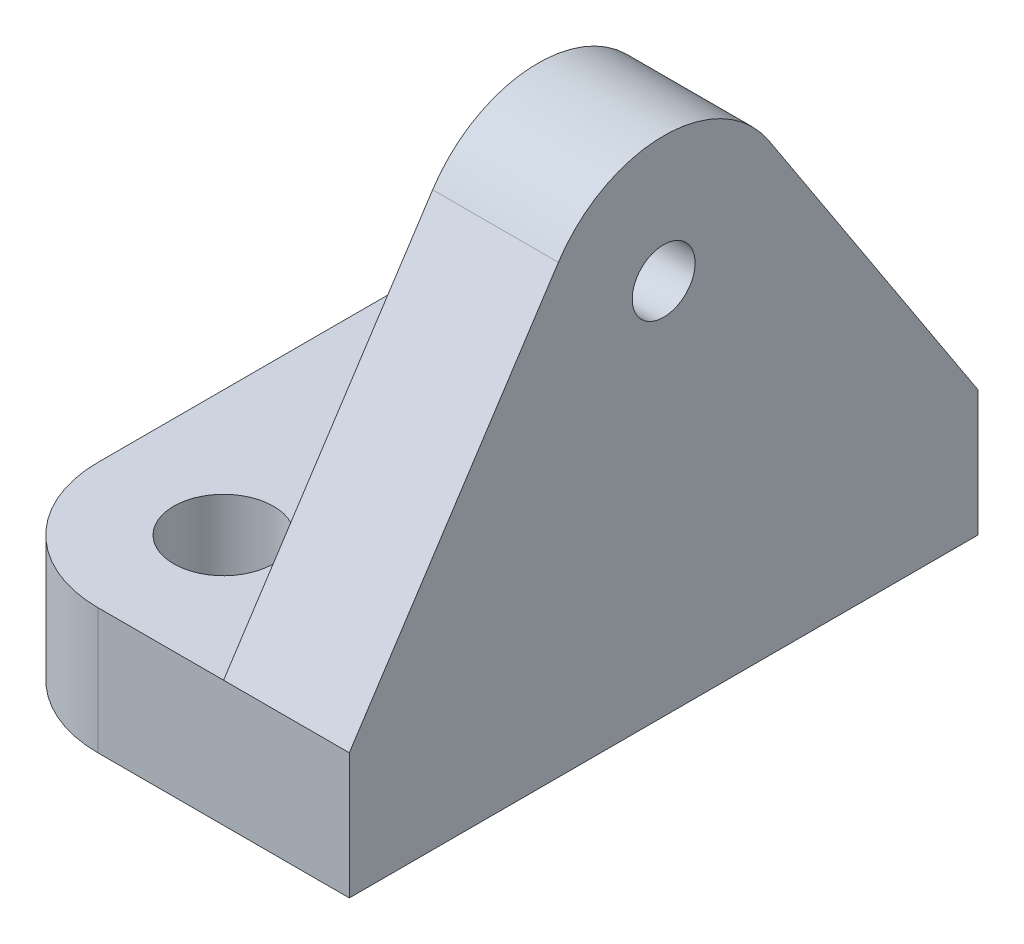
ISO-10303-21;
HEADER;
FILE_DESCRIPTION(('STEP AP214'),'2;1');
FILE_NAME('part.step','',(''),(''),'','','');
FILE_SCHEMA(('AUTOMOTIVE_DESIGN { 1 0 10303 214 1 1 1 1 }'));
ENDSEC;
DATA;
#1=APPLICATION_CONTEXT('core data for automotive mechanical design processes');
#2=APPLICATION_PROTOCOL_DEFINITION('international standard','automotive_design',2000,#1);
#3=PRODUCT_CONTEXT('',#1,'mechanical');
#4=PRODUCT('Part','Part','',(#3));
#5=PRODUCT_RELATED_PRODUCT_CATEGORY('part','',(#4));
#6=PRODUCT_DEFINITION_FORMATION('','',#4);
#7=PRODUCT_DEFINITION_CONTEXT('part definition',#1,'design');
#8=PRODUCT_DEFINITION('design','',#6,#7);
#9=PRODUCT_DEFINITION_SHAPE('','',#8);
#10=(LENGTH_UNIT() NAMED_UNIT(*) SI_UNIT(.MILLI.,.METRE.));
#11=(NAMED_UNIT(*) PLANE_ANGLE_UNIT() SI_UNIT($,.RADIAN.));
#12=(NAMED_UNIT(*) SI_UNIT($,.STERADIAN.) SOLID_ANGLE_UNIT());
#13=UNCERTAINTY_MEASURE_WITH_UNIT(LENGTH_MEASURE(1.E-05),#10,'distance_accuracy_value','');
#14=(GEOMETRIC_REPRESENTATION_CONTEXT(3) GLOBAL_UNCERTAINTY_ASSIGNED_CONTEXT((#13)) GLOBAL_UNIT_ASSIGNED_CONTEXT((#10,
#11,#12)) REPRESENTATION_CONTEXT('',''));
#15=CARTESIAN_POINT('',(0.,0.,0.));
#16=DIRECTION('',(0.,0.,1.));
#17=DIRECTION('',(1.,0.,0.));
#18=AXIS2_PLACEMENT_3D('',#15,#16,#17);
#19=CARTESIAN_POINT('',(38.1,-12.7,0.));
#20=DIRECTION('',(1.,0.,0.));
#21=DIRECTION('',(0.,0.,-1.));
#22=AXIS2_PLACEMENT_3D('',#19,#20,#21);
#23=PLANE('',#22);
#24=DIRECTION('',(0.,1.,0.));
#25=VECTOR('',#24,1.);
#26=CARTESIAN_POINT('',(38.1,-12.7,-63.5));
#27=LINE('',#26,#25);
#28=CARTESIAN_POINT('',(38.1,-12.7,-63.5));
#29=VERTEX_POINT('',#28);
#30=CARTESIAN_POINT('',(38.1,0.,-63.5));
#31=VERTEX_POINT('',#30);
#32=EDGE_CURVE('E84',#29,#31,#27,.T.);
#33=ORIENTED_EDGE('',*,*,#32,.T.);
#34=DIRECTION('',(0.,0.837342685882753,0.546678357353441));
#35=VECTOR('',#34,1.);
#36=CARTESIAN_POINT('',(38.1,0.,-63.5));
#37=LINE('',#36,#35);
#38=CARTESIAN_POINT('',(38.1,32.3428151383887,-42.384252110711));
#39=VERTEX_POINT('',#38);
#40=EDGE_CURVE('E156',#31,#39,#37,.T.);
#41=ORIENTED_EDGE('',*,*,#40,.T.);
#42=CARTESIAN_POINT('',(38.1,25.4,-31.75));
#43=DIRECTION('',(1.,0.,0.));
#44=DIRECTION('',(0.,0.,-1.));
#45=AXIS2_PLACEMENT_3D('',#42,#43,#44);
#46=CIRCLE('',#45,12.7);
#47=CARTESIAN_POINT('',(38.1,32.3428151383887,-21.115747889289));
#48=VERTEX_POINT('',#47);
#49=EDGE_CURVE('E173',#39,#48,#46,.T.);
#50=ORIENTED_EDGE('',*,*,#49,.T.);
#51=DIRECTION('',(0.,-0.837342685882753,0.546678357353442));
#52=VECTOR('',#51,1.);
#53=CARTESIAN_POINT('',(38.1,0.,0.));
#54=LINE('',#53,#52);
#55=CARTESIAN_POINT('',(38.1,0.,0.));
#56=VERTEX_POINT('',#55);
#57=EDGE_CURVE('E171',#48,#56,#54,.T.);
#58=ORIENTED_EDGE('',*,*,#57,.T.);
#59=DIRECTION('',(0.,1.,0.));
#60=VECTOR('',#59,1.);
#61=CARTESIAN_POINT('',(38.1,-12.7,0.));
#62=LINE('',#61,#60);
#63=CARTESIAN_POINT('',(38.1,-12.7,0.));
#64=VERTEX_POINT('',#63);
#65=EDGE_CURVE('E11',#64,#56,#62,.T.);
#66=ORIENTED_EDGE('',*,*,#65,.F.);
#67=DIRECTION('',(0.,0.,-1.));
#68=VECTOR('',#67,1.);
#69=CARTESIAN_POINT('',(38.1,-12.7,0.));
#70=LINE('',#69,#68);
#71=EDGE_CURVE('E139',#64,#29,#70,.T.);
#72=ORIENTED_EDGE('',*,*,#71,.T.);
#73=EDGE_LOOP('',(#33,#41,#50,#58,#66,#72));
#74=FACE_BOUND('',#73,.T.);
#75=CARTESIAN_POINT('',(38.1,25.4,-31.75));
#76=DIRECTION('',(1.,0.,0.));
#77=DIRECTION('',(0.,0.,-1.));
#78=AXIS2_PLACEMENT_3D('',#75,#76,#77);
#79=CIRCLE('',#78,3.175);
#80=CARTESIAN_POINT('',(38.1,25.4,-34.925));
#81=VERTEX_POINT('',#80);
#82=EDGE_CURVE('E207',#81,#81,#79,.T.);
#83=ORIENTED_EDGE('',*,*,#82,.F.);
#84=EDGE_LOOP('',(#83));
#85=FACE_BOUND('',#84,.T.);
#86=ADVANCED_FACE('F31',(#74,#85),#23,.T.);
#87=CARTESIAN_POINT('',(12.7000000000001,-12.7,0.));
#88=DIRECTION('',(0.,0.,1.));
#89=DIRECTION('',(1.,0.,0.));
#90=AXIS2_PLACEMENT_3D('',#87,#88,#89);
#91=PLANE('',#90);
#92=DIRECTION('',(1.,0.,0.));
#93=VECTOR('',#92,1.);
#94=CARTESIAN_POINT('',(12.7000000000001,0.,0.));
#95=LINE('',#94,#93);
#96=CARTESIAN_POINT('',(12.7000000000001,0.,0.));
#97=VERTEX_POINT('',#96);
#98=CARTESIAN_POINT('',(25.4,0.,0.));
#99=VERTEX_POINT('',#98);
#100=EDGE_CURVE('E135',#97,#99,#95,.T.);
#101=ORIENTED_EDGE('',*,*,#100,.F.);
#102=DIRECTION('',(0.,1.,0.));
#103=VECTOR('',#102,1.);
#104=CARTESIAN_POINT('',(12.7000000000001,-12.7,0.));
#105=LINE('',#104,#103);
#106=CARTESIAN_POINT('',(12.7000000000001,-12.7,0.));
#107=VERTEX_POINT('',#106);
#108=EDGE_CURVE('E39',#107,#97,#105,.T.);
#109=ORIENTED_EDGE('',*,*,#108,.F.);
#110=DIRECTION('',(1.,0.,0.));
#111=VECTOR('',#110,1.);
#112=CARTESIAN_POINT('',(12.7000000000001,-12.7,0.));
#113=LINE('',#112,#111);
#114=EDGE_CURVE('E114',#107,#64,#113,.T.);
#115=ORIENTED_EDGE('',*,*,#114,.T.);
#116=ORIENTED_EDGE('',*,*,#65,.T.);
#117=DIRECTION('',(1.,0.,0.));
#118=VECTOR('',#117,1.);
#119=CARTESIAN_POINT('',(25.4,0.,0.));
#120=LINE('',#119,#118);
#121=EDGE_CURVE('E182',#99,#56,#120,.T.);
#122=ORIENTED_EDGE('',*,*,#121,.F.);
#123=EDGE_LOOP('',(#101,#109,#115,#116,#122));
#124=FACE_BOUND('',#123,.T.);
#125=ADVANCED_FACE('F192',(#124),#91,.T.);
#126=CARTESIAN_POINT('',(12.7,-12.7,-12.7));
#127=DIRECTION('',(0.,1.,0.));
#128=DIRECTION('',(0.,0.,1.));
#129=AXIS2_PLACEMENT_3D('',#126,#127,#128);
#130=CYLINDRICAL_SURFACE('',#129,12.7);
#131=CARTESIAN_POINT('',(12.7,0.,-12.7));
#132=DIRECTION('',(0.,1.,0.));
#133=DIRECTION('',(0.,0.,-1.));
#134=AXIS2_PLACEMENT_3D('',#131,#132,#133);
#135=CIRCLE('',#134,12.7);
#136=CARTESIAN_POINT('',(0.,0.,-12.7000000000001));
#137=VERTEX_POINT('',#136);
#138=EDGE_CURVE('E100',#137,#97,#135,.T.);
#139=ORIENTED_EDGE('',*,*,#138,.F.);
#140=DIRECTION('',(0.,1.,0.));
#141=VECTOR('',#140,1.);
#142=CARTESIAN_POINT('',(0.,-12.7,-12.7000000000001));
#143=LINE('',#142,#141);
#144=CARTESIAN_POINT('',(0.,-12.7,-12.7000000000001));
#145=VERTEX_POINT('',#144);
#146=EDGE_CURVE('E95',#145,#137,#143,.T.);
#147=ORIENTED_EDGE('',*,*,#146,.F.);
#148=CARTESIAN_POINT('',(12.7,-12.7,-12.7));
#149=DIRECTION('',(0.,1.,0.));
#150=DIRECTION('',(0.,0.,-1.));
#151=AXIS2_PLACEMENT_3D('',#148,#149,#150);
#152=CIRCLE('',#151,12.7);
#153=EDGE_CURVE('E98',#145,#107,#152,.T.);
#154=ORIENTED_EDGE('',*,*,#153,.T.);
#155=ORIENTED_EDGE('',*,*,#108,.T.);
#156=EDGE_LOOP('',(#139,#147,#154,#155));
#157=FACE_BOUND('',#156,.T.);
#158=ADVANCED_FACE('F97',(#157),#130,.T.);
#159=CARTESIAN_POINT('',(0.,-12.7,-12.7000000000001));
#160=DIRECTION('',(-1.,0.,0.));
#161=DIRECTION('',(0.,0.,1.));
#162=AXIS2_PLACEMENT_3D('',#159,#160,#161);
#163=PLANE('',#162);
#164=DIRECTION('',(0.,0.,1.));
#165=VECTOR('',#164,1.);
#166=CARTESIAN_POINT('',(0.,0.,-12.7000000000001));
#167=LINE('',#166,#165);
#168=CARTESIAN_POINT('',(0.,0.,-50.7999999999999));
#169=VERTEX_POINT('',#168);
#170=EDGE_CURVE('E189',#169,#137,#167,.T.);
#171=ORIENTED_EDGE('',*,*,#170,.F.);
#172=DIRECTION('',(0.,1.,0.));
#173=VECTOR('',#172,1.);
#174=CARTESIAN_POINT('',(0.,-12.7,-50.7999999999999));
#175=LINE('',#174,#173);
#176=CARTESIAN_POINT('',(0.,-12.7,-50.7999999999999));
#177=VERTEX_POINT('',#176);
#178=EDGE_CURVE('E105',#177,#169,#175,.T.);
#179=ORIENTED_EDGE('',*,*,#178,.F.);
#180=DIRECTION('',(0.,0.,1.));
#181=VECTOR('',#180,1.);
#182=CARTESIAN_POINT('',(0.,-12.7,-12.7000000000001));
#183=LINE('',#182,#181);
#184=EDGE_CURVE('E111',#177,#145,#183,.T.);
#185=ORIENTED_EDGE('',*,*,#184,.T.);
#186=ORIENTED_EDGE('',*,*,#146,.T.);
#187=EDGE_LOOP('',(#171,#179,#185,#186));
#188=FACE_BOUND('',#187,.T.);
#189=ADVANCED_FACE('F116',(#188),#163,.T.);
#190=CARTESIAN_POINT('',(12.7,-12.7,-50.8));
#191=DIRECTION('',(0.,1.,0.));
#192=DIRECTION('',(0.,0.,1.));
#193=AXIS2_PLACEMENT_3D('',#190,#191,#192);
#194=CYLINDRICAL_SURFACE('',#193,12.7);
#195=CARTESIAN_POINT('',(12.7,0.,-50.8));
#196=DIRECTION('',(0.,1.,0.));
#197=DIRECTION('',(0.,0.,-1.));
#198=AXIS2_PLACEMENT_3D('',#195,#196,#197);
#199=CIRCLE('',#198,12.7);
#200=CARTESIAN_POINT('',(12.7000000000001,0.,-63.5));
#201=VERTEX_POINT('',#200);
#202=EDGE_CURVE('E126',#201,#169,#199,.T.);
#203=ORIENTED_EDGE('',*,*,#202,.F.);
#204=DIRECTION('',(0.,1.,0.));
#205=VECTOR('',#204,1.);
#206=CARTESIAN_POINT('',(12.7000000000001,-12.7,-63.5));
#207=LINE('',#206,#205);
#208=CARTESIAN_POINT('',(12.7000000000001,-12.7,-63.5));
#209=VERTEX_POINT('',#208);
#210=EDGE_CURVE('E148',#209,#201,#207,.T.);
#211=ORIENTED_EDGE('',*,*,#210,.F.);
#212=CARTESIAN_POINT('',(12.7,-12.7,-50.8));
#213=DIRECTION('',(0.,1.,0.));
#214=DIRECTION('',(0.,0.,-1.));
#215=AXIS2_PLACEMENT_3D('',#212,#213,#214);
#216=CIRCLE('',#215,12.7);
#217=EDGE_CURVE('E117',#209,#177,#216,.T.);
#218=ORIENTED_EDGE('',*,*,#217,.T.);
#219=ORIENTED_EDGE('',*,*,#178,.T.);
#220=EDGE_LOOP('',(#203,#211,#218,#219));
#221=FACE_BOUND('',#220,.T.);
#222=ADVANCED_FACE('F188',(#221),#194,.T.);
#223=CARTESIAN_POINT('',(12.7000000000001,-12.7,-63.5));
#224=DIRECTION('',(0.,0.,-1.));
#225=DIRECTION('',(-1.,0.,0.));
#226=AXIS2_PLACEMENT_3D('',#223,#224,#225);
#227=PLANE('',#226);
#228=DIRECTION('',(-1.,0.,0.));
#229=VECTOR('',#228,1.);
#230=CARTESIAN_POINT('',(12.7000000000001,0.,-63.5));
#231=LINE('',#230,#229);
#232=CARTESIAN_POINT('',(25.4,0.,-63.5));
#233=VERTEX_POINT('',#232);
#234=EDGE_CURVE('E133',#31,#233,#231,.T.);
#235=ORIENTED_EDGE('',*,*,#234,.F.);
#236=ORIENTED_EDGE('',*,*,#32,.F.);
#237=DIRECTION('',(-1.,0.,0.));
#238=VECTOR('',#237,1.);
#239=CARTESIAN_POINT('',(12.7000000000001,-12.7,-63.5));
#240=LINE('',#239,#238);
#241=EDGE_CURVE('E119',#29,#209,#240,.T.);
#242=ORIENTED_EDGE('',*,*,#241,.T.);
#243=ORIENTED_EDGE('',*,*,#210,.T.);
#244=EDGE_CURVE('E130',#233,#201,#231,.T.);
#245=ORIENTED_EDGE('',*,*,#244,.F.);
#246=EDGE_LOOP('',(#235,#236,#242,#243,#245));
#247=FACE_BOUND('',#246,.T.);
#248=ADVANCED_FACE('F159',(#247),#227,.T.);
#249=CARTESIAN_POINT('',(12.7,-12.7,-50.8));
#250=DIRECTION('',(0.,-1.,0.));
#251=DIRECTION('',(0.,0.,-1.));
#252=AXIS2_PLACEMENT_3D('',#249,#250,#251);
#253=PLANE('',#252);
#254=CARTESIAN_POINT('',(12.7,-12.7,-50.8));
#255=DIRECTION('',(0.,-1.,0.));
#256=DIRECTION('',(0.,0.,-1.));
#257=AXIS2_PLACEMENT_3D('',#254,#255,#256);
#258=CIRCLE('',#257,5.04189999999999);
#259=CARTESIAN_POINT('',(12.7,-12.7,-55.8419));
#260=VERTEX_POINT('',#259);
#261=EDGE_CURVE('E219',#260,#260,#258,.T.);
#262=ORIENTED_EDGE('',*,*,#261,.F.);
#263=EDGE_LOOP('',(#262));
#264=FACE_BOUND('',#263,.T.);
#265=CARTESIAN_POINT('',(12.7,-12.7,-12.7));
#266=DIRECTION('',(0.,-1.,0.));
#267=DIRECTION('',(0.,0.,-1.));
#268=AXIS2_PLACEMENT_3D('',#265,#266,#267);
#269=CIRCLE('',#268,5.04189999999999);
#270=CARTESIAN_POINT('',(12.7,-12.7,-17.7419));
#271=VERTEX_POINT('',#270);
#272=EDGE_CURVE('E208',#271,#271,#269,.T.);
#273=ORIENTED_EDGE('',*,*,#272,.F.);
#274=EDGE_LOOP('',(#273));
#275=FACE_BOUND('',#274,.T.);
#276=ORIENTED_EDGE('',*,*,#71,.F.);
#277=ORIENTED_EDGE('',*,*,#114,.F.);
#278=ORIENTED_EDGE('',*,*,#153,.F.);
#279=ORIENTED_EDGE('',*,*,#184,.F.);
#280=ORIENTED_EDGE('',*,*,#217,.F.);
#281=ORIENTED_EDGE('',*,*,#241,.F.);
#282=EDGE_LOOP('',(#276,#277,#278,#279,#280,#281));
#283=FACE_BOUND('',#282,.T.);
#284=ADVANCED_FACE('F109',(#264,#275,#283),#253,.T.);
#285=CARTESIAN_POINT('',(12.7,0.,-50.8));
#286=DIRECTION('',(0.,-1.,0.));
#287=DIRECTION('',(0.,0.,-1.));
#288=AXIS2_PLACEMENT_3D('',#285,#286,#287);
#289=PLANE('',#288);
#290=CARTESIAN_POINT('',(12.7,0.,-50.8));
#291=DIRECTION('',(0.,-1.,0.));
#292=DIRECTION('',(0.,0.,-1.));
#293=AXIS2_PLACEMENT_3D('',#290,#291,#292);
#294=CIRCLE('',#293,5.04189999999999);
#295=CARTESIAN_POINT('',(12.7,0.,-55.8419));
#296=VERTEX_POINT('',#295);
#297=EDGE_CURVE('E34',#296,#296,#294,.T.);
#298=ORIENTED_EDGE('',*,*,#297,.T.);
#299=EDGE_LOOP('',(#298));
#300=FACE_BOUND('',#299,.T.);
#301=CARTESIAN_POINT('',(12.7,0.,-12.7));
#302=DIRECTION('',(0.,-1.,0.));
#303=DIRECTION('',(0.,0.,-1.));
#304=AXIS2_PLACEMENT_3D('',#301,#302,#303);
#305=CIRCLE('',#304,5.04189999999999);
#306=CARTESIAN_POINT('',(12.7,0.,-17.7419));
#307=VERTEX_POINT('',#306);
#308=EDGE_CURVE('E205',#307,#307,#305,.T.);
#309=ORIENTED_EDGE('',*,*,#308,.T.);
#310=EDGE_LOOP('',(#309));
#311=FACE_BOUND('',#310,.T.);
#312=ORIENTED_EDGE('',*,*,#100,.T.);
#313=DIRECTION('',(0.,0.,-1.));
#314=VECTOR('',#313,1.);
#315=CARTESIAN_POINT('',(25.4,0.,0.));
#316=LINE('',#315,#314);
#317=EDGE_CURVE('E140',#99,#233,#316,.T.);
#318=ORIENTED_EDGE('',*,*,#317,.T.);
#319=ORIENTED_EDGE('',*,*,#244,.T.);
#320=ORIENTED_EDGE('',*,*,#202,.T.);
#321=ORIENTED_EDGE('',*,*,#170,.T.);
#322=ORIENTED_EDGE('',*,*,#138,.T.);
#323=EDGE_LOOP('',(#312,#318,#319,#320,#321,#322));
#324=FACE_BOUND('',#323,.T.);
#325=ADVANCED_FACE('F166',(#300,#311,#324),#289,.F.);
#326=CARTESIAN_POINT('',(25.4,0.,0.));
#327=DIRECTION('',(0.,0.546678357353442,0.837342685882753));
#328=DIRECTION('',(0.,-0.837342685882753,0.546678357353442));
#329=AXIS2_PLACEMENT_3D('',#326,#327,#328);
#330=PLANE('',#329);
#331=ORIENTED_EDGE('',*,*,#57,.F.);
#332=DIRECTION('',(1.,0.,0.));
#333=VECTOR('',#332,1.);
#334=CARTESIAN_POINT('',(25.4,32.3428151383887,-21.115747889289));
#335=LINE('',#334,#333);
#336=CARTESIAN_POINT('',(25.4,32.3428151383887,-21.115747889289));
#337=VERTEX_POINT('',#336);
#338=EDGE_CURVE('E179',#337,#48,#335,.T.);
#339=ORIENTED_EDGE('',*,*,#338,.F.);
#340=DIRECTION('',(0.,-0.837342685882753,0.546678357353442));
#341=VECTOR('',#340,1.);
#342=CARTESIAN_POINT('',(25.4,0.,0.));
#343=LINE('',#342,#341);
#344=EDGE_CURVE('E185',#337,#99,#343,.T.);
#345=ORIENTED_EDGE('',*,*,#344,.T.);
#346=ORIENTED_EDGE('',*,*,#121,.T.);
#347=EDGE_LOOP('',(#331,#339,#345,#346));
#348=FACE_BOUND('',#347,.T.);
#349=ADVANCED_FACE('F234',(#348),#330,.T.);
#350=CARTESIAN_POINT('',(25.4,25.4,-31.75));
#351=DIRECTION('',(1.,0.,0.));
#352=DIRECTION('',(0.,0.,-1.));
#353=AXIS2_PLACEMENT_3D('',#350,#351,#352);
#354=CYLINDRICAL_SURFACE('',#353,12.7);
#355=ORIENTED_EDGE('',*,*,#49,.F.);
#356=DIRECTION('',(1.,0.,0.));
#357=VECTOR('',#356,1.);
#358=CARTESIAN_POINT('',(25.4,32.3428151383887,-42.384252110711));
#359=LINE('',#358,#357);
#360=CARTESIAN_POINT('',(25.4,32.3428151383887,-42.384252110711));
#361=VERTEX_POINT('',#360);
#362=EDGE_CURVE('E183',#361,#39,#359,.T.);
#363=ORIENTED_EDGE('',*,*,#362,.F.);
#364=CARTESIAN_POINT('',(25.4,25.4,-31.75));
#365=DIRECTION('',(1.,0.,0.));
#366=DIRECTION('',(0.,0.,-1.));
#367=AXIS2_PLACEMENT_3D('',#364,#365,#366);
#368=CIRCLE('',#367,12.7);
#369=EDGE_CURVE('E172',#361,#337,#368,.T.);
#370=ORIENTED_EDGE('',*,*,#369,.T.);
#371=ORIENTED_EDGE('',*,*,#338,.T.);
#372=EDGE_LOOP('',(#355,#363,#370,#371));
#373=FACE_BOUND('',#372,.T.);
#374=ADVANCED_FACE('F229',(#373),#354,.T.);
#375=CARTESIAN_POINT('',(25.4,0.,-63.5));
#376=DIRECTION('',(0.,0.546678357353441,-0.837342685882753));
#377=DIRECTION('',(0.,0.837342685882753,0.546678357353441));
#378=AXIS2_PLACEMENT_3D('',#375,#376,#377);
#379=PLANE('',#378);
#380=ORIENTED_EDGE('',*,*,#40,.F.);
#381=ORIENTED_EDGE('',*,*,#234,.T.);
#382=DIRECTION('',(0.,0.837342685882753,0.546678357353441));
#383=VECTOR('',#382,1.);
#384=CARTESIAN_POINT('',(25.4,0.,-63.5));
#385=LINE('',#384,#383);
#386=EDGE_CURVE('E47',#233,#361,#385,.T.);
#387=ORIENTED_EDGE('',*,*,#386,.T.);
#388=ORIENTED_EDGE('',*,*,#362,.T.);
#389=EDGE_LOOP('',(#380,#381,#387,#388));
#390=FACE_BOUND('',#389,.T.);
#391=ADVANCED_FACE('F162',(#390),#379,.T.);
#392=CARTESIAN_POINT('',(25.4,25.4,-31.75));
#393=DIRECTION('',(1.,0.,0.));
#394=DIRECTION('',(0.,0.,-1.));
#395=AXIS2_PLACEMENT_3D('',#392,#393,#394);
#396=PLANE('',#395);
#397=CARTESIAN_POINT('',(25.4,25.4,-31.75));
#398=DIRECTION('',(1.,0.,0.));
#399=DIRECTION('',(0.,0.,-1.));
#400=AXIS2_PLACEMENT_3D('',#397,#398,#399);
#401=CIRCLE('',#400,3.175);
#402=CARTESIAN_POINT('',(25.4,25.4,-34.925));
#403=VERTEX_POINT('',#402);
#404=EDGE_CURVE('E212',#403,#403,#401,.T.);
#405=ORIENTED_EDGE('',*,*,#404,.T.);
#406=EDGE_LOOP('',(#405));
#407=FACE_BOUND('',#406,.T.);
#408=ORIENTED_EDGE('',*,*,#317,.F.);
#409=ORIENTED_EDGE('',*,*,#344,.F.);
#410=ORIENTED_EDGE('',*,*,#369,.F.);
#411=ORIENTED_EDGE('',*,*,#386,.F.);
#412=EDGE_LOOP('',(#408,#409,#410,#411));
#413=FACE_BOUND('',#412,.T.);
#414=ADVANCED_FACE('F233',(#407,#413),#396,.F.);
#415=CARTESIAN_POINT('',(25.4,25.4,-31.75));
#416=DIRECTION('',(1.,0.,0.));
#417=DIRECTION('',(0.,0.,-1.));
#418=AXIS2_PLACEMENT_3D('',#415,#416,#417);
#419=CYLINDRICAL_SURFACE('',#418,3.175);
#420=ORIENTED_EDGE('',*,*,#404,.F.);
#421=EDGE_LOOP('',(#420));
#422=FACE_BOUND('',#421,.T.);
#423=ORIENTED_EDGE('',*,*,#82,.T.);
#424=EDGE_LOOP('',(#423));
#425=FACE_BOUND('',#424,.T.);
#426=ADVANCED_FACE('F275',(#422,#425),#419,.F.);
#427=CARTESIAN_POINT('',(12.7,-12.7,-12.7));
#428=DIRECTION('',(0.,-1.,0.));
#429=DIRECTION('',(0.,0.,-1.));
#430=AXIS2_PLACEMENT_3D('',#427,#428,#429);
#431=CYLINDRICAL_SURFACE('',#430,5.04189999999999);
#432=ORIENTED_EDGE('',*,*,#272,.T.);
#433=EDGE_LOOP('',(#432));
#434=FACE_BOUND('',#433,.T.);
#435=ORIENTED_EDGE('',*,*,#308,.F.);
#436=EDGE_LOOP('',(#435));
#437=FACE_BOUND('',#436,.T.);
#438=ADVANCED_FACE('F280',(#434,#437),#431,.F.);
#439=CARTESIAN_POINT('',(12.7,-12.7,-50.8));
#440=DIRECTION('',(0.,-1.,0.));
#441=DIRECTION('',(0.,0.,-1.));
#442=AXIS2_PLACEMENT_3D('',#439,#440,#441);
#443=CYLINDRICAL_SURFACE('',#442,5.04189999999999);
#444=ORIENTED_EDGE('',*,*,#261,.T.);
#445=EDGE_LOOP('',(#444));
#446=FACE_BOUND('',#445,.T.);
#447=ORIENTED_EDGE('',*,*,#297,.F.);
#448=EDGE_LOOP('',(#447));
#449=FACE_BOUND('',#448,.T.);
#450=ADVANCED_FACE('F286',(#446,#449),#443,.F.);
#451=CLOSED_SHELL('',(#86,#125,#158,#189,#222,#248,#284,#325,#349,#374,#391,#414,#426,#438,#450));
#452=MANIFOLD_SOLID_BREP('B2',#451);
#453=ADVANCED_BREP_SHAPE_REPRESENTATION('',(#18,#452),#14);
#454=SHAPE_DEFINITION_REPRESENTATION(#9,#453);
ENDSEC;
END-ISO-10303-21;
